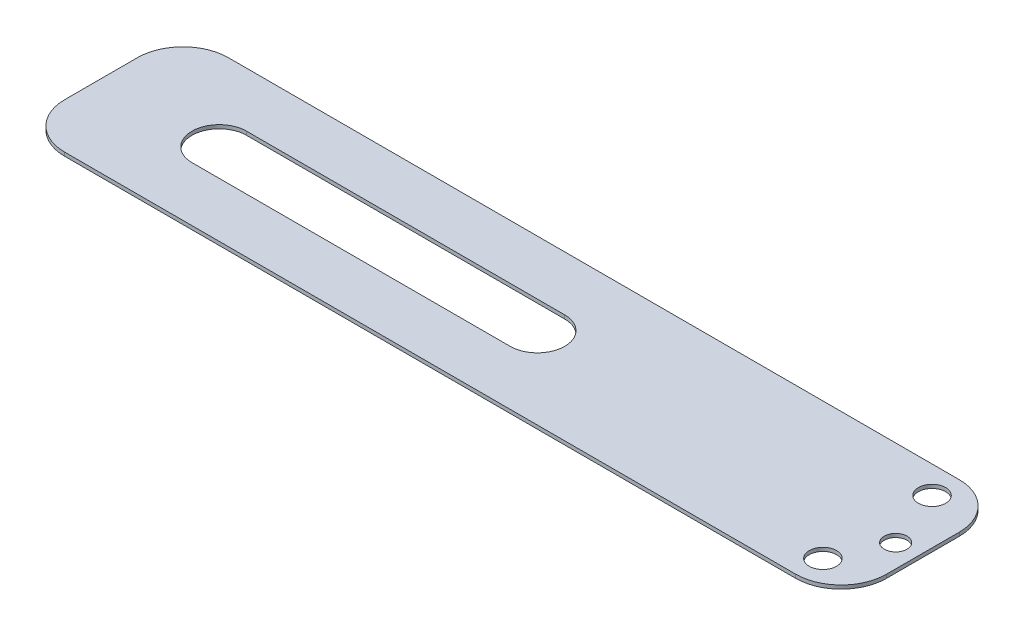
from build123d import *

# Parameters (mm, degrees)
SKETCH1_W           = 90.4
SKETCH1_H           = 18
BOSS_EXTRUDE1_DEPTH = 0.4
SKETCH2_R           = 1.5
SKETCH2_R_2         = 1.25
CUT_EXTRUDE1_DEPTH  = 93.17548481
FILLET1_R           = 5
FILLET4_R           = 5
FILLET6_R           = 5


with BuildPart() as part:
    # Sketch1 → Boss-Extrude1 (new body)
    with BuildSketch(Plane(origin=(0, 0, 0), x_dir=(1, 0, 0), z_dir=(0, 1, 0))):
        with Locations((-45.2, -9)):
            Rectangle(SKETCH1_W, SKETCH1_H)
    extrude(amount=BOSS_EXTRUDE1_DEPTH)

    # Sketch2 → Cut-Extrude1 (cut, through all)
    with BuildSketch(Plane(origin=(0, 0.4, 0), x_dir=(1, 0, 0), z_dir=(0, 1, 0))):
        with Locations(Location((-5, -3, 0), (0, 0, 270))):
            Circle(SKETCH2_R)
        with Locations(Location((-5, -15, 0), (0, 0, 270))):
            Circle(SKETCH2_R)
        with Locations(Location((-2.5, -9.5, 0), (0, 0, 270))):
            Circle(SKETCH2_R_2)
        with BuildLine():
            Line((-77.4, -12), (-42.4, -12))
            ThreePointArc((-42.4, -12), (-39.4, -9), (-42.4, -6))
            Line((-42.4, -6), (-77.4, -6))
            ThreePointArc((-77.4, -6), (-80.4, -9), (-77.4, -12))
        make_face()
    extrude(amount=-CUT_EXTRUDE1_DEPTH, mode=Mode.SUBTRACT)

    # Fillet1
    fillet1_edges = [part.edges().sort_by_distance(p)[0] for p in [
        (-90.4, 0.2, 0),
        (-90.4, 0.2, 18),
    ]]
    fillet(fillet1_edges, radius=FILLET1_R)

    # Fillet4
    fillet4_edges = [part.edges().sort_by_distance(p)[0] for p in [
        (0, 0.2, 0),
    ]]
    fillet(fillet4_edges, radius=FILLET4_R)

    # Fillet6
    fillet6_edges = [part.edges().sort_by_distance(p)[0] for p in [
        (0, 0.2, 18),
    ]]
    fillet(fillet6_edges, radius=FILLET6_R)


solid = part.part
